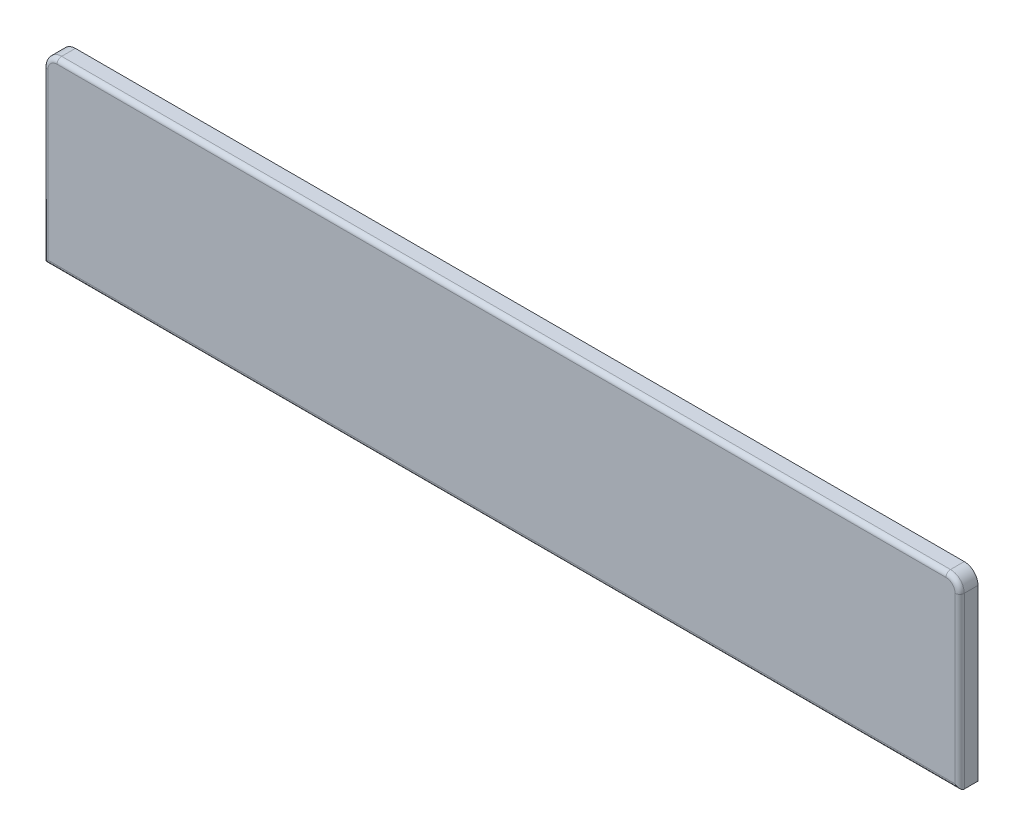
from build123d import *

# Parameters (mm, degrees)
SKETCH_1_W      = 2000
SKETCH_1_H      = 400
EXTRUDE_1_DEPTH = 40
FILLET_2_R      = 30
FILLET_3_R      = 10


with BuildPart() as part:
    # Sketch 1 → Extrude 1 (new body)
    with BuildSketch(Plane.XY):
        with Locations((-1000, -200)):
            Rectangle(SKETCH_1_W, SKETCH_1_H)
    extrude(amount=EXTRUDE_1_DEPTH)

    # Fillet 2
    fillet_2_edges = [part.edges().sort_by_distance(p)[0] for p in [
        (-2000, 0, 20),
        (0, 0, 20),
    ]]
    fillet(fillet_2_edges, radius=FILLET_2_R)

    # Fillet 3
    fillet_3_edges = [part.edges().sort_by_distance(p)[0] for p in [
        (-1000, -400, 40),
        (-1000, 0, 40),
        (-2000, -215, 40),
        (-1991.213203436, -8.786796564, 40),
        (-8.786796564, -8.786796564, 40),
        (0, -215, 40),
    ]]
    fillet(fillet_3_edges, radius=FILLET_3_R)


solid = part.part
